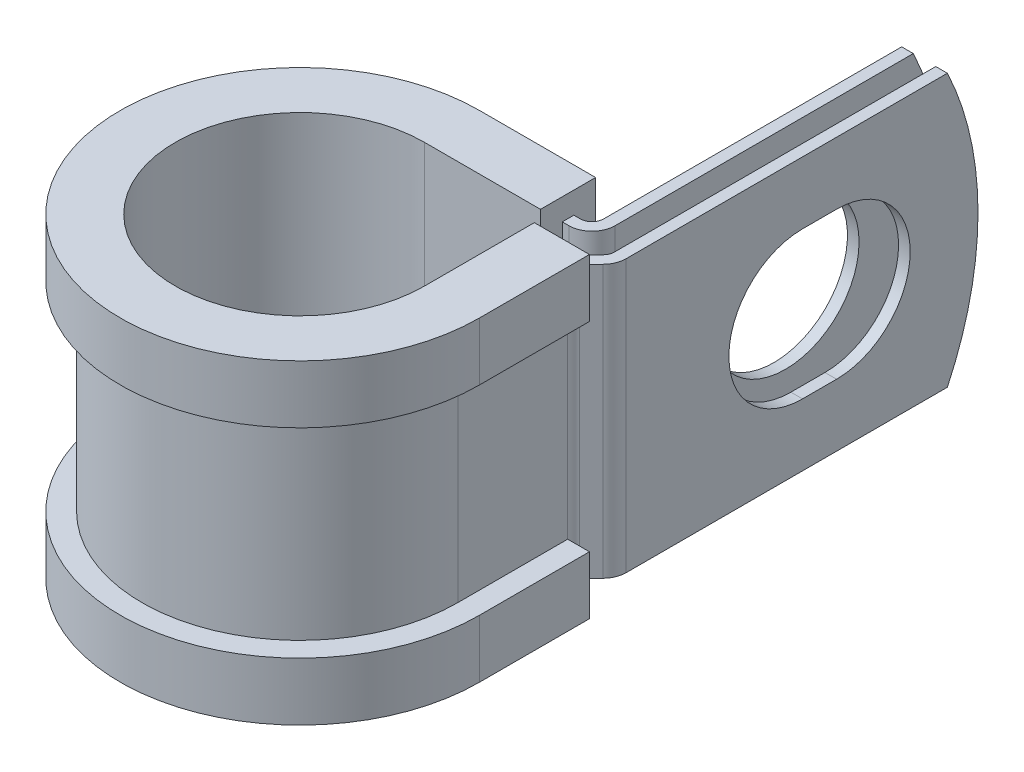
ISO-10303-21;
HEADER;
FILE_DESCRIPTION(('STEP AP214'),'2;1');
FILE_NAME('part.step','',(''),(''),'','','');
FILE_SCHEMA(('AUTOMOTIVE_DESIGN { 1 0 10303 214 1 1 1 1 }'));
ENDSEC;
DATA;
#1=APPLICATION_CONTEXT('core data for automotive mechanical design processes');
#2=APPLICATION_PROTOCOL_DEFINITION('international standard','automotive_design',2000,#1);
#3=PRODUCT_CONTEXT('',#1,'mechanical');
#4=PRODUCT('Part','Part','',(#3));
#5=PRODUCT_RELATED_PRODUCT_CATEGORY('part','',(#4));
#6=PRODUCT_DEFINITION_FORMATION('','',#4);
#7=PRODUCT_DEFINITION_CONTEXT('part definition',#1,'design');
#8=PRODUCT_DEFINITION('design','',#6,#7);
#9=PRODUCT_DEFINITION_SHAPE('','',#8);
#10=(LENGTH_UNIT() NAMED_UNIT(*) SI_UNIT(.MILLI.,.METRE.));
#11=(NAMED_UNIT(*) PLANE_ANGLE_UNIT() SI_UNIT($,.RADIAN.));
#12=(NAMED_UNIT(*) SI_UNIT($,.STERADIAN.) SOLID_ANGLE_UNIT());
#13=UNCERTAINTY_MEASURE_WITH_UNIT(LENGTH_MEASURE(1.E-05),#10,'distance_accuracy_value','');
#14=(GEOMETRIC_REPRESENTATION_CONTEXT(3) GLOBAL_UNCERTAINTY_ASSIGNED_CONTEXT((#13)) GLOBAL_UNIT_ASSIGNED_CONTEXT((#10,
#11,#12)) REPRESENTATION_CONTEXT('',''));
#15=CARTESIAN_POINT('',(0.,0.,0.));
#16=DIRECTION('',(0.,0.,1.));
#17=DIRECTION('',(1.,0.,0.));
#18=AXIS2_PLACEMENT_3D('',#15,#16,#17);
#19=CARTESIAN_POINT('',(10.9764743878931,-9.525,-10.2489));
#20=DIRECTION('',(0.,1.,0.));
#21=DIRECTION('',(1.,0.,0.));
#22=AXIS2_PLACEMENT_3D('',#19,#20,#21);
#23=PLANE('',#22);
#24=DIRECTION('',(0.,0.,-1.));
#25=VECTOR('',#24,1.);
#26=CARTESIAN_POINT('',(8.13167438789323,-9.525,-10.2489));
#27=LINE('',#26,#25);
#28=CARTESIAN_POINT('',(8.13167438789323,-9.525,-10.2489));
#29=VERTEX_POINT('',#28);
#30=CARTESIAN_POINT('',(8.13167438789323,-9.525,-11.0617));
#31=VERTEX_POINT('',#30);
#32=EDGE_CURVE('E523',#29,#31,#27,.T.);
#33=ORIENTED_EDGE('',*,*,#32,.T.);
#34=DIRECTION('',(1.,0.,0.));
#35=VECTOR('',#34,1.);
#36=CARTESIAN_POINT('',(0.,-9.525,-11.0617));
#37=LINE('',#36,#35);
#38=CARTESIAN_POINT('',(8.58887438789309,-9.525,-11.0617));
#39=VERTEX_POINT('',#38);
#40=EDGE_CURVE('E410',#39,#31,#37,.F.);
#41=ORIENTED_EDGE('',*,*,#40,.F.);
#42=CARTESIAN_POINT('',(8.58887438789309,-9.525,-11.8745));
#43=DIRECTION('',(0.,1.,0.));
#44=DIRECTION('',(1.,0.,0.));
#45=AXIS2_PLACEMENT_3D('',#42,#43,#44);
#46=CIRCLE('',#45,0.812799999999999);
#47=CARTESIAN_POINT('',(9.40167438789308,-9.525,-11.8745));
#48=VERTEX_POINT('',#47);
#49=EDGE_CURVE('E408',#48,#39,#46,.F.);
#50=ORIENTED_EDGE('',*,*,#49,.F.);
#51=DIRECTION('',(0.,0.,1.));
#52=VECTOR('',#51,1.);
#53=CARTESIAN_POINT('',(9.40167438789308,-9.525,-34.8996));
#54=LINE('',#53,#52);
#55=CARTESIAN_POINT('',(9.40167438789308,-9.525,-32.7550631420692));
#56=VERTEX_POINT('',#55);
#57=EDGE_CURVE('E406',#56,#48,#54,.T.);
#58=ORIENTED_EDGE('',*,*,#57,.F.);
#59=DIRECTION('',(-1.,0.,0.));
#60=VECTOR('',#59,1.);
#61=CARTESIAN_POINT('',(12.6020743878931,-9.525,-32.7550631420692));
#62=LINE('',#61,#60);
#63=CARTESIAN_POINT('',(10.2144743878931,-9.525,-32.7550631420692));
#64=VERTEX_POINT('',#63);
#65=EDGE_CURVE('E12',#64,#56,#62,.T.);
#66=ORIENTED_EDGE('',*,*,#65,.F.);
#67=DIRECTION('',(0.,0.,1.));
#68=VECTOR('',#67,1.);
#69=CARTESIAN_POINT('',(10.2144743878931,-9.525,-34.8996));
#70=LINE('',#69,#68);
#71=CARTESIAN_POINT('',(10.2144743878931,-9.525,-11.8745));
#72=VERTEX_POINT('',#71);
#73=EDGE_CURVE('E404',#64,#72,#70,.T.);
#74=ORIENTED_EDGE('',*,*,#73,.T.);
#75=CARTESIAN_POINT('',(8.58887438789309,-9.525,-11.8745));
#76=DIRECTION('',(0.,-1.,0.));
#77=DIRECTION('',(0.,0.,1.));
#78=AXIS2_PLACEMENT_3D('',#75,#76,#77);
#79=CIRCLE('',#78,1.6256);
#80=CARTESIAN_POINT('',(8.58887438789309,-9.525,-10.2489));
#81=VERTEX_POINT('',#80);
#82=EDGE_CURVE('E401',#72,#81,#79,.T.);
#83=ORIENTED_EDGE('',*,*,#82,.T.);
#84=DIRECTION('',(-1.,0.,0.));
#85=VECTOR('',#84,1.);
#86=CARTESIAN_POINT('',(0.,-9.525,-10.2489));
#87=LINE('',#86,#85);
#88=EDGE_CURVE('E398',#81,#29,#87,.T.);
#89=ORIENTED_EDGE('',*,*,#88,.T.);
#90=EDGE_LOOP('',(#33,#41,#50,#58,#66,#74,#83,#89));
#91=FACE_BOUND('',#90,.T.);
#92=ADVANCED_FACE('F54',(#91),#23,.F.);
#93=CARTESIAN_POINT('',(10.9764743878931,9.525,-10.2489));
#94=DIRECTION('',(0.,1.,0.));
#95=DIRECTION('',(1.,0.,0.));
#96=AXIS2_PLACEMENT_3D('',#93,#94,#95);
#97=PLANE('',#96);
#98=DIRECTION('',(1.,0.,0.));
#99=VECTOR('',#98,1.);
#100=CARTESIAN_POINT('',(0.,9.525,-11.0617));
#101=LINE('',#100,#99);
#102=CARTESIAN_POINT('',(8.58887438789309,9.525,-11.0617));
#103=VERTEX_POINT('',#102);
#104=CARTESIAN_POINT('',(8.13167438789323,9.525,-11.0617));
#105=VERTEX_POINT('',#104);
#106=EDGE_CURVE('E368',#103,#105,#101,.F.);
#107=ORIENTED_EDGE('',*,*,#106,.T.);
#108=DIRECTION('',(0.,0.,1.));
#109=VECTOR('',#108,1.);
#110=CARTESIAN_POINT('',(8.13167438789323,9.525,-11.0617));
#111=LINE('',#110,#109);
#112=CARTESIAN_POINT('',(8.13167438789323,9.525,-10.2489));
#113=VERTEX_POINT('',#112);
#114=EDGE_CURVE('E517',#105,#113,#111,.T.);
#115=ORIENTED_EDGE('',*,*,#114,.T.);
#116=DIRECTION('',(-1.,0.,0.));
#117=VECTOR('',#116,1.);
#118=CARTESIAN_POINT('',(0.,9.525,-10.2489));
#119=LINE('',#118,#117);
#120=CARTESIAN_POINT('',(8.58887438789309,9.525,-10.2489));
#121=VERTEX_POINT('',#120);
#122=EDGE_CURVE('E625',#121,#113,#119,.T.);
#123=ORIENTED_EDGE('',*,*,#122,.F.);
#124=CARTESIAN_POINT('',(8.58887438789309,9.525,-11.8745));
#125=DIRECTION('',(0.,-1.,0.));
#126=DIRECTION('',(0.,0.,1.));
#127=AXIS2_PLACEMENT_3D('',#124,#125,#126);
#128=CIRCLE('',#127,1.6256);
#129=CARTESIAN_POINT('',(10.2144743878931,9.525,-11.8745));
#130=VERTEX_POINT('',#129);
#131=EDGE_CURVE('E370',#130,#121,#128,.T.);
#132=ORIENTED_EDGE('',*,*,#131,.F.);
#133=DIRECTION('',(0.,0.,1.));
#134=VECTOR('',#133,1.);
#135=CARTESIAN_POINT('',(10.2144743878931,9.525,-34.8996));
#136=LINE('',#135,#134);
#137=CARTESIAN_POINT('',(10.2144743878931,9.525,-32.7550631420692));
#138=VERTEX_POINT('',#137);
#139=EDGE_CURVE('E361',#138,#130,#136,.T.);
#140=ORIENTED_EDGE('',*,*,#139,.F.);
#141=DIRECTION('',(-1.,0.,0.));
#142=VECTOR('',#141,1.);
#143=CARTESIAN_POINT('',(12.6020743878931,9.525,-32.7550631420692));
#144=LINE('',#143,#142);
#145=CARTESIAN_POINT('',(9.40167438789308,9.525,-32.7550631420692));
#146=VERTEX_POINT('',#145);
#147=EDGE_CURVE('E62',#138,#146,#144,.T.);
#148=ORIENTED_EDGE('',*,*,#147,.T.);
#149=DIRECTION('',(0.,0.,1.));
#150=VECTOR('',#149,1.);
#151=CARTESIAN_POINT('',(9.40167438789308,9.525,-34.8996));
#152=LINE('',#151,#150);
#153=CARTESIAN_POINT('',(9.40167438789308,9.525,-11.8745));
#154=VERTEX_POINT('',#153);
#155=EDGE_CURVE('E358',#146,#154,#152,.T.);
#156=ORIENTED_EDGE('',*,*,#155,.T.);
#157=CARTESIAN_POINT('',(8.58887438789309,9.525,-11.8745));
#158=DIRECTION('',(0.,1.,0.));
#159=DIRECTION('',(1.,0.,0.));
#160=AXIS2_PLACEMENT_3D('',#157,#158,#159);
#161=CIRCLE('',#160,0.812799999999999);
#162=EDGE_CURVE('E366',#154,#103,#161,.F.);
#163=ORIENTED_EDGE('',*,*,#162,.T.);
#164=EDGE_LOOP('',(#107,#115,#123,#132,#140,#148,#156,#163));
#165=FACE_BOUND('',#164,.T.);
#166=ADVANCED_FACE('F357',(#165),#97,.T.);
#167=CARTESIAN_POINT('',(0.,9.525,-10.2489));
#168=DIRECTION('',(0.,0.,1.));
#169=DIRECTION('',(1.,0.,0.));
#170=AXIS2_PLACEMENT_3D('',#167,#168,#169);
#171=PLANE('',#170);
#172=ORIENTED_EDGE('',*,*,#122,.T.);
#173=DIRECTION('',(0.,-1.,0.));
#174=VECTOR('',#173,1.);
#175=CARTESIAN_POINT('',(8.13167438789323,9.525,-10.2489));
#176=LINE('',#175,#174);
#177=EDGE_CURVE('E520',#113,#29,#176,.T.);
#178=ORIENTED_EDGE('',*,*,#177,.T.);
#179=ORIENTED_EDGE('',*,*,#88,.F.);
#180=DIRECTION('',(0.,-1.,0.));
#181=VECTOR('',#180,1.);
#182=CARTESIAN_POINT('',(8.58887438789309,9.525,-10.2489));
#183=LINE('',#182,#181);
#184=EDGE_CURVE('E344',#121,#81,#183,.T.);
#185=ORIENTED_EDGE('',*,*,#184,.F.);
#186=EDGE_LOOP('',(#172,#178,#179,#185));
#187=FACE_BOUND('',#186,.T.);
#188=ADVANCED_FACE('F635',(#187),#171,.T.);
#189=CARTESIAN_POINT('',(12.6020743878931,9.525,-10.2489));
#190=DIRECTION('',(-1.,0.,0.));
#191=DIRECTION('',(0.,0.,1.));
#192=AXIS2_PLACEMENT_3D('',#189,#190,#191);
#193=PLANE('',#192);
#194=CARTESIAN_POINT('',(12.6020743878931,0.,-24.9935999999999));
#195=DIRECTION('',(1.,0.,0.));
#196=DIRECTION('',(0.,0.,-1.));
#197=AXIS2_PLACEMENT_3D('',#194,#195,#196);
#198=CIRCLE('',#197,5.1562);
#199=CARTESIAN_POINT('',(12.6020743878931,-5.1562,-24.9936000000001));
#200=VERTEX_POINT('',#199);
#201=CARTESIAN_POINT('',(12.6020743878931,5.1562,-24.9936000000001));
#202=VERTEX_POINT('',#201);
#203=EDGE_CURVE('E580',#200,#202,#198,.T.);
#204=ORIENTED_EDGE('',*,*,#203,.F.);
#205=DIRECTION('',(0.,0.,-1.));
#206=VECTOR('',#205,1.);
#207=CARTESIAN_POINT('',(12.6020743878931,-5.1562,-22.6059999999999));
#208=LINE('',#207,#206);
#209=CARTESIAN_POINT('',(12.6020743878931,-5.1562,-22.6059999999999));
#210=VERTEX_POINT('',#209);
#211=EDGE_CURVE('E583',#210,#200,#208,.T.);
#212=ORIENTED_EDGE('',*,*,#211,.F.);
#213=CARTESIAN_POINT('',(12.6020743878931,0.,-22.6059999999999));
#214=DIRECTION('',(1.,0.,0.));
#215=DIRECTION('',(0.,0.,-1.));
#216=AXIS2_PLACEMENT_3D('',#213,#214,#215);
#217=CIRCLE('',#216,5.1562);
#218=CARTESIAN_POINT('',(12.6020743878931,5.1562,-22.6059999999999));
#219=VERTEX_POINT('',#218);
#220=EDGE_CURVE('E576',#219,#210,#217,.T.);
#221=ORIENTED_EDGE('',*,*,#220,.F.);
#222=DIRECTION('',(0.,0.,1.));
#223=VECTOR('',#222,1.);
#224=CARTESIAN_POINT('',(12.6020743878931,5.1562,-22.6059999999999));
#225=LINE('',#224,#223);
#226=EDGE_CURVE('E577',#202,#219,#225,.T.);
#227=ORIENTED_EDGE('',*,*,#226,.F.);
#228=EDGE_LOOP('',(#204,#212,#221,#227));
#229=FACE_BOUND('',#228,.T.);
#230=DIRECTION('',(0.,0.,-1.));
#231=VECTOR('',#230,1.);
#232=CARTESIAN_POINT('',(12.6020743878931,-9.525,-10.2489));
#233=LINE('',#232,#231);
#234=CARTESIAN_POINT('',(12.6020743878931,-9.525,-10.2489));
#235=VERTEX_POINT('',#234);
#236=CARTESIAN_POINT('',(12.6020743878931,-9.525,-32.7550631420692));
#237=VERTEX_POINT('',#236);
#238=EDGE_CURVE('E382',#235,#237,#233,.T.);
#239=ORIENTED_EDGE('',*,*,#238,.T.);
#240=CARTESIAN_POINT('',(12.6020743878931,0.,-12.6746));
#241=DIRECTION('',(-1.,0.,0.));
#242=DIRECTION('',(0.,0.,1.));
#243=AXIS2_PLACEMENT_3D('',#240,#241,#242);
#244=CIRCLE('',#243,22.225);
#245=CARTESIAN_POINT('',(12.6020743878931,9.525,-32.7550631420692));
#246=VERTEX_POINT('',#245);
#247=EDGE_CURVE('E568',#246,#237,#244,.T.);
#248=ORIENTED_EDGE('',*,*,#247,.F.);
#249=DIRECTION('',(0.,0.,-1.));
#250=VECTOR('',#249,1.);
#251=CARTESIAN_POINT('',(12.6020743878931,9.525,-10.2489));
#252=LINE('',#251,#250);
#253=CARTESIAN_POINT('',(12.6020743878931,9.525,-10.2489));
#254=VERTEX_POINT('',#253);
#255=EDGE_CURVE('E419',#254,#246,#252,.T.);
#256=ORIENTED_EDGE('',*,*,#255,.F.);
#257=DIRECTION('',(0.,-1.,0.));
#258=VECTOR('',#257,1.);
#259=CARTESIAN_POINT('',(12.6020743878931,9.525,-10.2489));
#260=LINE('',#259,#258);
#261=EDGE_CURVE('E381',#254,#235,#260,.T.);
#262=ORIENTED_EDGE('',*,*,#261,.T.);
#263=EDGE_LOOP('',(#239,#248,#256,#262));
#264=FACE_BOUND('',#263,.T.);
#265=ADVANCED_FACE('F56',(#229,#264),#193,.F.);
#266=CARTESIAN_POINT('',(11.7892743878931,9.525,-10.2489));
#267=DIRECTION('',(-1.,0.,0.));
#268=DIRECTION('',(0.,0.,1.));
#269=AXIS2_PLACEMENT_3D('',#266,#267,#268);
#270=PLANE('',#269);
#271=DIRECTION('',(0.,0.,-1.));
#272=VECTOR('',#271,1.);
#273=CARTESIAN_POINT('',(11.7892743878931,-5.1562,-22.6059999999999));
#274=LINE('',#273,#272);
#275=CARTESIAN_POINT('',(11.7892743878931,-5.1562,-22.6059999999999));
#276=VERTEX_POINT('',#275);
#277=CARTESIAN_POINT('',(11.7892743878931,-5.1562,-24.9936000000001));
#278=VERTEX_POINT('',#277);
#279=EDGE_CURVE('E579',#276,#278,#274,.T.);
#280=ORIENTED_EDGE('',*,*,#279,.T.);
#281=CARTESIAN_POINT('',(11.7892743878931,0.,-24.9935999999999));
#282=DIRECTION('',(-1.,0.,0.));
#283=DIRECTION('',(0.,0.,1.));
#284=AXIS2_PLACEMENT_3D('',#281,#282,#283);
#285=CIRCLE('',#284,5.1562);
#286=CARTESIAN_POINT('',(11.7892743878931,5.1562,-24.9936000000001));
#287=VERTEX_POINT('',#286);
#288=EDGE_CURVE('E600',#278,#287,#285,.F.);
#289=ORIENTED_EDGE('',*,*,#288,.T.);
#290=DIRECTION('',(0.,0.,1.));
#291=VECTOR('',#290,1.);
#292=CARTESIAN_POINT('',(11.7892743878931,5.1562,-22.6059999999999));
#293=LINE('',#292,#291);
#294=CARTESIAN_POINT('',(11.7892743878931,5.1562,-22.6059999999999));
#295=VERTEX_POINT('',#294);
#296=EDGE_CURVE('E596',#287,#295,#293,.T.);
#297=ORIENTED_EDGE('',*,*,#296,.T.);
#298=CARTESIAN_POINT('',(11.7892743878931,0.,-22.6059999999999));
#299=DIRECTION('',(-1.,0.,0.));
#300=DIRECTION('',(0.,0.,1.));
#301=AXIS2_PLACEMENT_3D('',#298,#299,#300);
#302=CIRCLE('',#301,5.1562);
#303=EDGE_CURVE('E591',#295,#276,#302,.F.);
#304=ORIENTED_EDGE('',*,*,#303,.T.);
#305=EDGE_LOOP('',(#280,#289,#297,#304));
#306=FACE_BOUND('',#305,.T.);
#307=CARTESIAN_POINT('',(11.7892743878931,0.,-12.6746));
#308=DIRECTION('',(-1.,0.,0.));
#309=DIRECTION('',(0.,0.,1.));
#310=AXIS2_PLACEMENT_3D('',#307,#308,#309);
#311=CIRCLE('',#310,22.225);
#312=CARTESIAN_POINT('',(11.7892743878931,9.525,-32.7550631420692));
#313=VERTEX_POINT('',#312);
#314=CARTESIAN_POINT('',(11.7892743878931,-9.525,-32.7550631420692));
#315=VERTEX_POINT('',#314);
#316=EDGE_CURVE('E76',#313,#315,#311,.T.);
#317=ORIENTED_EDGE('',*,*,#316,.T.);
#318=DIRECTION('',(0.,0.,-1.));
#319=VECTOR('',#318,1.);
#320=CARTESIAN_POINT('',(11.7892743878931,-9.525,-10.2489));
#321=LINE('',#320,#319);
#322=CARTESIAN_POINT('',(11.7892743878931,-9.525,-10.2489));
#323=VERTEX_POINT('',#322);
#324=EDGE_CURVE('E385',#323,#315,#321,.T.);
#325=ORIENTED_EDGE('',*,*,#324,.F.);
#326=DIRECTION('',(0.,-1.,0.));
#327=VECTOR('',#326,1.);
#328=CARTESIAN_POINT('',(11.7892743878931,9.525,-10.2489));
#329=LINE('',#328,#327);
#330=CARTESIAN_POINT('',(11.7892743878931,9.525,-10.2489));
#331=VERTEX_POINT('',#330);
#332=EDGE_CURVE('E352',#331,#323,#329,.T.);
#333=ORIENTED_EDGE('',*,*,#332,.F.);
#334=DIRECTION('',(0.,0.,-1.));
#335=VECTOR('',#334,1.);
#336=CARTESIAN_POINT('',(11.7892743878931,9.525,-10.2489));
#337=LINE('',#336,#335);
#338=EDGE_CURVE('E615',#331,#313,#337,.T.);
#339=ORIENTED_EDGE('',*,*,#338,.T.);
#340=EDGE_LOOP('',(#317,#325,#333,#339));
#341=FACE_BOUND('',#340,.T.);
#342=ADVANCED_FACE('F689',(#306,#341),#270,.T.);
#343=CARTESIAN_POINT('',(10.2144743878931,9.525,-34.8996));
#344=DIRECTION('',(1.,0.,0.));
#345=DIRECTION('',(0.,0.,-1.));
#346=AXIS2_PLACEMENT_3D('',#343,#344,#345);
#347=PLANE('',#346);
#348=CARTESIAN_POINT('',(10.2144743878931,0.,-23.7998));
#349=DIRECTION('',(1.,0.,0.));
#350=DIRECTION('',(0.,0.,-1.));
#351=AXIS2_PLACEMENT_3D('',#348,#349,#350);
#352=CIRCLE('',#351,5.1562);
#353=CARTESIAN_POINT('',(10.2144743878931,0.,-28.956));
#354=VERTEX_POINT('',#353);
#355=EDGE_CURVE('E386',#354,#354,#352,.F.);
#356=ORIENTED_EDGE('',*,*,#355,.T.);
#357=EDGE_LOOP('',(#356));
#358=FACE_BOUND('',#357,.T.);
#359=ORIENTED_EDGE('',*,*,#73,.F.);
#360=CARTESIAN_POINT('',(10.2144743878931,0.,-12.6746));
#361=DIRECTION('',(1.,0.,0.));
#362=DIRECTION('',(0.,0.,-1.));
#363=AXIS2_PLACEMENT_3D('',#360,#361,#362);
#364=CIRCLE('',#363,22.225);
#365=EDGE_CURVE('E573',#64,#138,#364,.T.);
#366=ORIENTED_EDGE('',*,*,#365,.T.);
#367=ORIENTED_EDGE('',*,*,#139,.T.);
#368=DIRECTION('',(0.,-1.,0.));
#369=VECTOR('',#368,1.);
#370=CARTESIAN_POINT('',(10.2144743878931,9.525,-11.8745));
#371=LINE('',#370,#369);
#372=EDGE_CURVE('E341',#130,#72,#371,.T.);
#373=ORIENTED_EDGE('',*,*,#372,.T.);
#374=EDGE_LOOP('',(#359,#366,#367,#373));
#375=FACE_BOUND('',#374,.T.);
#376=ADVANCED_FACE('F641',(#358,#375),#347,.T.);
#377=CARTESIAN_POINT('',(9.40167438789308,9.525,-34.8996));
#378=DIRECTION('',(1.,0.,0.));
#379=DIRECTION('',(0.,0.,-1.));
#380=AXIS2_PLACEMENT_3D('',#377,#378,#379);
#381=PLANE('',#380);
#382=CARTESIAN_POINT('',(9.40167438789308,0.,-23.7998));
#383=DIRECTION('',(-1.,0.,0.));
#384=DIRECTION('',(0.,0.,1.));
#385=AXIS2_PLACEMENT_3D('',#382,#383,#384);
#386=CIRCLE('',#385,5.1562);
#387=CARTESIAN_POINT('',(9.40167438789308,0.,-18.6436));
#388=VERTEX_POINT('',#387);
#389=EDGE_CURVE('E608',#388,#388,#386,.T.);
#390=ORIENTED_EDGE('',*,*,#389,.F.);
#391=EDGE_LOOP('',(#390));
#392=FACE_BOUND('',#391,.T.);
#393=CARTESIAN_POINT('',(9.40167438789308,0.,-12.6746));
#394=DIRECTION('',(-1.,0.,0.));
#395=DIRECTION('',(0.,0.,1.));
#396=AXIS2_PLACEMENT_3D('',#393,#394,#395);
#397=CIRCLE('',#396,22.225);
#398=EDGE_CURVE('E68',#146,#56,#397,.T.);
#399=ORIENTED_EDGE('',*,*,#398,.T.);
#400=ORIENTED_EDGE('',*,*,#57,.T.);
#401=DIRECTION('',(0.,-1.,0.));
#402=VECTOR('',#401,1.);
#403=CARTESIAN_POINT('',(9.40167438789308,9.525,-11.8745));
#404=LINE('',#403,#402);
#405=EDGE_CURVE('E338',#154,#48,#404,.T.);
#406=ORIENTED_EDGE('',*,*,#405,.F.);
#407=ORIENTED_EDGE('',*,*,#155,.F.);
#408=EDGE_LOOP('',(#399,#400,#406,#407));
#409=FACE_BOUND('',#408,.T.);
#410=ADVANCED_FACE('F364',(#392,#409),#381,.F.);
#411=CARTESIAN_POINT('',(11.8745,-9.525,-7.69850726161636));
#412=DIRECTION('',(0.,1.,0.));
#413=DIRECTION('',(1.,0.,0.));
#414=AXIS2_PLACEMENT_3D('',#411,#412,#413);
#415=CIRCLE('',#414,0.8128);
#416=CARTESIAN_POINT('',(11.0617,-9.525,-7.69850726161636));
#417=VERTEX_POINT('',#416);
#418=CARTESIAN_POINT('',(11.2997636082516,-9.525,-8.27324365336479));
#419=VERTEX_POINT('',#418);
#420=EDGE_CURVE('E413',#417,#419,#415,.F.);
#421=ORIENTED_EDGE('',*,*,#420,.F.);
#422=DIRECTION('',(1.,0.,0.));
#423=VECTOR('',#422,1.);
#424=CARTESIAN_POINT('',(10.2489,-9.525,-7.69850726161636));
#425=LINE('',#424,#423);
#426=CARTESIAN_POINT('',(10.2489,-9.525,-7.69850726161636));
#427=VERTEX_POINT('',#426);
#428=EDGE_CURVE('E451',#427,#417,#425,.T.);
#429=ORIENTED_EDGE('',*,*,#428,.F.);
#430=CARTESIAN_POINT('',(11.8745,-9.525,-7.69850726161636));
#431=DIRECTION('',(0.,-1.,0.));
#432=DIRECTION('',(0.,0.,1.));
#433=AXIS2_PLACEMENT_3D('',#430,#431,#432);
#434=CIRCLE('',#433,1.6256);
#435=CARTESIAN_POINT('',(10.7250272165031,-9.525,-8.84798004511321));
#436=VERTEX_POINT('',#435);
#437=EDGE_CURVE('E395',#427,#436,#434,.T.);
#438=ORIENTED_EDGE('',*,*,#437,.T.);
#439=DIRECTION('',(0.707106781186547,0.,-0.707106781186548));
#440=VECTOR('',#439,1.);
#441=CARTESIAN_POINT('',(10.7250272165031,-9.525,-8.84798004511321));
#442=LINE('',#441,#440);
#443=CARTESIAN_POINT('',(11.5512107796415,-9.525,-9.67416360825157));
#444=VERTEX_POINT('',#443);
#445=EDGE_CURVE('E392',#436,#444,#442,.T.);
#446=ORIENTED_EDGE('',*,*,#445,.T.);
#447=CARTESIAN_POINT('',(10.9764743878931,-9.525,-10.2489));
#448=DIRECTION('',(0.,1.,0.));
#449=DIRECTION('',(0.,0.,1.));
#450=AXIS2_PLACEMENT_3D('',#447,#448,#449);
#451=CIRCLE('',#450,0.812800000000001);
#452=EDGE_CURVE('E389',#444,#323,#451,.T.);
#453=ORIENTED_EDGE('',*,*,#452,.T.);
#454=ORIENTED_EDGE('',*,*,#324,.T.);
#455=DIRECTION('',(-1.,0.,0.));
#456=VECTOR('',#455,1.);
#457=CARTESIAN_POINT('',(12.6020743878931,-9.525,-32.7550631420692));
#458=LINE('',#457,#456);
#459=EDGE_CURVE('E566',#237,#315,#458,.T.);
#460=ORIENTED_EDGE('',*,*,#459,.F.);
#461=ORIENTED_EDGE('',*,*,#238,.F.);
#462=CARTESIAN_POINT('',(10.9764743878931,-9.525,-10.2489));
#463=DIRECTION('',(0.,1.,0.));
#464=DIRECTION('',(1.,0.,0.));
#465=AXIS2_PLACEMENT_3D('',#462,#463,#464);
#466=CIRCLE('',#465,1.6256);
#467=CARTESIAN_POINT('',(12.1259471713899,-9.525,-9.09942721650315));
#468=VERTEX_POINT('',#467);
#469=EDGE_CURVE('E417',#468,#235,#466,.T.);
#470=ORIENTED_EDGE('',*,*,#469,.F.);
#471=DIRECTION('',(0.707106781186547,0.,-0.707106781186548));
#472=VECTOR('',#471,1.);
#473=CARTESIAN_POINT('',(11.2997636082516,-9.525,-8.27324365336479));
#474=LINE('',#473,#472);
#475=EDGE_CURVE('E415',#419,#468,#474,.T.);
#476=ORIENTED_EDGE('',*,*,#475,.F.);
#477=EDGE_LOOP('',(#421,#429,#438,#446,#453,#454,#460,#461,#470,#476));
#478=FACE_BOUND('',#477,.T.);
#479=ADVANCED_FACE('F675',(#478),#23,.F.);
#480=DIRECTION('',(-1.,0.,0.));
#481=VECTOR('',#480,1.);
#482=CARTESIAN_POINT('',(11.0617,9.525,-7.69850726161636));
#483=LINE('',#482,#481);
#484=CARTESIAN_POINT('',(11.0617,9.525,-7.69850726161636));
#485=VERTEX_POINT('',#484);
#486=CARTESIAN_POINT('',(10.2489,9.525,-7.69850726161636));
#487=VERTEX_POINT('',#486);
#488=EDGE_CURVE('E440',#485,#487,#483,.T.);
#489=ORIENTED_EDGE('',*,*,#488,.F.);
#490=CARTESIAN_POINT('',(11.8745,9.525,-7.69850726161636));
#491=DIRECTION('',(0.,1.,0.));
#492=DIRECTION('',(1.,0.,0.));
#493=AXIS2_PLACEMENT_3D('',#490,#491,#492);
#494=CIRCLE('',#493,0.8128);
#495=CARTESIAN_POINT('',(11.2997636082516,9.525,-8.27324365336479));
#496=VERTEX_POINT('',#495);
#497=EDGE_CURVE('E375',#485,#496,#494,.F.);
#498=ORIENTED_EDGE('',*,*,#497,.T.);
#499=DIRECTION('',(0.707106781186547,0.,-0.707106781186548));
#500=VECTOR('',#499,1.);
#501=CARTESIAN_POINT('',(11.2997636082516,9.525,-8.27324365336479));
#502=LINE('',#501,#500);
#503=CARTESIAN_POINT('',(12.1259471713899,9.525,-9.09942721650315));
#504=VERTEX_POINT('',#503);
#505=EDGE_CURVE('E377',#496,#504,#502,.T.);
#506=ORIENTED_EDGE('',*,*,#505,.T.);
#507=CARTESIAN_POINT('',(10.9764743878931,9.525,-10.2489));
#508=DIRECTION('',(0.,1.,0.));
#509=DIRECTION('',(1.,0.,0.));
#510=AXIS2_PLACEMENT_3D('',#507,#508,#509);
#511=CIRCLE('',#510,1.6256);
#512=EDGE_CURVE('E379',#504,#254,#511,.T.);
#513=ORIENTED_EDGE('',*,*,#512,.T.);
#514=ORIENTED_EDGE('',*,*,#255,.T.);
#515=DIRECTION('',(-1.,0.,0.));
#516=VECTOR('',#515,1.);
#517=CARTESIAN_POINT('',(12.6020743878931,9.525,-32.7550631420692));
#518=LINE('',#517,#516);
#519=EDGE_CURVE('E570',#246,#313,#518,.T.);
#520=ORIENTED_EDGE('',*,*,#519,.T.);
#521=ORIENTED_EDGE('',*,*,#338,.F.);
#522=CARTESIAN_POINT('',(10.9764743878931,9.525,-10.2489));
#523=DIRECTION('',(0.,1.,0.));
#524=DIRECTION('',(0.,0.,1.));
#525=AXIS2_PLACEMENT_3D('',#522,#523,#524);
#526=CIRCLE('',#525,0.812800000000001);
#527=CARTESIAN_POINT('',(11.5512107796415,9.525,-9.67416360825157));
#528=VERTEX_POINT('',#527);
#529=EDGE_CURVE('E618',#528,#331,#526,.T.);
#530=ORIENTED_EDGE('',*,*,#529,.F.);
#531=DIRECTION('',(0.707106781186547,0.,-0.707106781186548));
#532=VECTOR('',#531,1.);
#533=CARTESIAN_POINT('',(10.7250272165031,9.525,-8.84798004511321));
#534=LINE('',#533,#532);
#535=CARTESIAN_POINT('',(10.7250272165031,9.525,-8.84798004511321));
#536=VERTEX_POINT('',#535);
#537=EDGE_CURVE('E621',#536,#528,#534,.T.);
#538=ORIENTED_EDGE('',*,*,#537,.F.);
#539=CARTESIAN_POINT('',(11.8745,9.525,-7.69850726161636));
#540=DIRECTION('',(0.,-1.,0.));
#541=DIRECTION('',(0.,0.,1.));
#542=AXIS2_PLACEMENT_3D('',#539,#540,#541);
#543=CIRCLE('',#542,1.6256);
#544=EDGE_CURVE('E450',#487,#536,#543,.T.);
#545=ORIENTED_EDGE('',*,*,#544,.F.);
#546=EDGE_LOOP('',(#489,#498,#506,#513,#514,#520,#521,#530,#538,#545));
#547=FACE_BOUND('',#546,.T.);
#548=ADVANCED_FACE('F447',(#547),#97,.T.);
#549=CARTESIAN_POINT('',(10.9764743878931,9.525,-10.2489));
#550=DIRECTION('',(0.,-1.,0.));
#551=DIRECTION('',(0.,0.,-1.));
#552=AXIS2_PLACEMENT_3D('',#549,#550,#551);
#553=CYLINDRICAL_SURFACE('',#552,0.812800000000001);
#554=ORIENTED_EDGE('',*,*,#452,.F.);
#555=DIRECTION('',(0.,-1.,0.));
#556=VECTOR('',#555,1.);
#557=CARTESIAN_POINT('',(11.5512107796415,9.525,-9.67416360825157));
#558=LINE('',#557,#556);
#559=EDGE_CURVE('E350',#528,#444,#558,.T.);
#560=ORIENTED_EDGE('',*,*,#559,.F.);
#561=ORIENTED_EDGE('',*,*,#529,.T.);
#562=ORIENTED_EDGE('',*,*,#332,.T.);
#563=EDGE_LOOP('',(#554,#560,#561,#562));
#564=FACE_BOUND('',#563,.T.);
#565=ADVANCED_FACE('F685',(#564),#553,.F.);
#566=CARTESIAN_POINT('',(10.7250272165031,9.525,-8.84798004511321));
#567=DIRECTION('',(-0.707106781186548,0.,-0.707106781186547));
#568=DIRECTION('',(-0.707106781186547,0.,0.707106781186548));
#569=AXIS2_PLACEMENT_3D('',#566,#567,#568);
#570=PLANE('',#569);
#571=ORIENTED_EDGE('',*,*,#445,.F.);
#572=DIRECTION('',(0.,-1.,0.));
#573=VECTOR('',#572,1.);
#574=CARTESIAN_POINT('',(10.7250272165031,9.525,-8.84798004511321));
#575=LINE('',#574,#573);
#576=EDGE_CURVE('E348',#536,#436,#575,.T.);
#577=ORIENTED_EDGE('',*,*,#576,.F.);
#578=ORIENTED_EDGE('',*,*,#537,.T.);
#579=ORIENTED_EDGE('',*,*,#559,.T.);
#580=EDGE_LOOP('',(#571,#577,#578,#579));
#581=FACE_BOUND('',#580,.T.);
#582=ADVANCED_FACE('F680',(#581),#570,.T.);
#583=CARTESIAN_POINT('',(11.8745,9.525,-7.69850726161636));
#584=DIRECTION('',(0.,-1.,0.));
#585=DIRECTION('',(0.,0.,-1.));
#586=AXIS2_PLACEMENT_3D('',#583,#584,#585);
#587=CYLINDRICAL_SURFACE('',#586,1.6256);
#588=ORIENTED_EDGE('',*,*,#437,.F.);
#589=DIRECTION('',(0.,-1.,0.));
#590=VECTOR('',#589,1.);
#591=CARTESIAN_POINT('',(10.2489,9.525,-7.69850726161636));
#592=LINE('',#591,#590);
#593=EDGE_CURVE('E346',#487,#427,#592,.T.);
#594=ORIENTED_EDGE('',*,*,#593,.F.);
#595=ORIENTED_EDGE('',*,*,#544,.T.);
#596=ORIENTED_EDGE('',*,*,#576,.T.);
#597=EDGE_LOOP('',(#588,#594,#595,#596));
#598=FACE_BOUND('',#597,.T.);
#599=ADVANCED_FACE('F677',(#598),#587,.T.);
#600=CARTESIAN_POINT('',(8.58887438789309,9.525,-11.8745));
#601=DIRECTION('',(0.,-1.,0.));
#602=DIRECTION('',(0.,0.,-1.));
#603=AXIS2_PLACEMENT_3D('',#600,#601,#602);
#604=CYLINDRICAL_SURFACE('',#603,1.6256);
#605=ORIENTED_EDGE('',*,*,#82,.F.);
#606=ORIENTED_EDGE('',*,*,#372,.F.);
#607=ORIENTED_EDGE('',*,*,#131,.T.);
#608=ORIENTED_EDGE('',*,*,#184,.T.);
#609=EDGE_LOOP('',(#605,#606,#607,#608));
#610=FACE_BOUND('',#609,.T.);
#611=ADVANCED_FACE('F631',(#610),#604,.T.);
#612=CARTESIAN_POINT('',(8.58887438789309,9.525,-11.8745));
#613=DIRECTION('',(0.,-1.,0.));
#614=DIRECTION('',(0.,0.,-1.));
#615=AXIS2_PLACEMENT_3D('',#612,#613,#614);
#616=CYLINDRICAL_SURFACE('',#615,0.812799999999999);
#617=ORIENTED_EDGE('',*,*,#49,.T.);
#618=DIRECTION('',(0.,-1.,0.));
#619=VECTOR('',#618,1.);
#620=CARTESIAN_POINT('',(8.58887438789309,9.525,-11.0617));
#621=LINE('',#620,#619);
#622=EDGE_CURVE('E329',#103,#39,#621,.T.);
#623=ORIENTED_EDGE('',*,*,#622,.F.);
#624=ORIENTED_EDGE('',*,*,#162,.F.);
#625=ORIENTED_EDGE('',*,*,#405,.T.);
#626=EDGE_LOOP('',(#617,#623,#624,#625));
#627=FACE_BOUND('',#626,.T.);
#628=ADVANCED_FACE('F646',(#627),#616,.F.);
#629=CARTESIAN_POINT('',(0.,9.525,-11.0617));
#630=DIRECTION('',(0.,0.,1.));
#631=DIRECTION('',(1.,0.,0.));
#632=AXIS2_PLACEMENT_3D('',#629,#630,#631);
#633=PLANE('',#632);
#634=DIRECTION('',(0.,-1.,0.));
#635=VECTOR('',#634,1.);
#636=CARTESIAN_POINT('',(0.,9.525,-11.0617));
#637=LINE('',#636,#635);
#638=CARTESIAN_POINT('',(1.55164210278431E-13,6.985,-11.0617));
#639=VERTEX_POINT('',#638);
#640=CARTESIAN_POINT('',(1.55164210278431E-13,-6.985,-11.0617));
#641=VERTEX_POINT('',#640);
#642=EDGE_CURVE('E320',#639,#641,#637,.T.);
#643=ORIENTED_EDGE('',*,*,#642,.F.);
#644=DIRECTION('',(1.,0.,0.));
#645=VECTOR('',#644,1.);
#646=CARTESIAN_POINT('',(1.55164210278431E-13,6.985,-11.0617));
#647=LINE('',#646,#645);
#648=CARTESIAN_POINT('',(8.13167438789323,6.985,-11.0617));
#649=VERTEX_POINT('',#648);
#650=EDGE_CURVE('E563',#639,#649,#647,.T.);
#651=ORIENTED_EDGE('',*,*,#650,.T.);
#652=DIRECTION('',(0.,1.,0.));
#653=VECTOR('',#652,1.);
#654=CARTESIAN_POINT('',(8.13167438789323,9.525,-11.0617));
#655=LINE('',#654,#653);
#656=EDGE_CURVE('E514',#649,#105,#655,.T.);
#657=ORIENTED_EDGE('',*,*,#656,.T.);
#658=ORIENTED_EDGE('',*,*,#106,.F.);
#659=ORIENTED_EDGE('',*,*,#622,.T.);
#660=ORIENTED_EDGE('',*,*,#40,.T.);
#661=DIRECTION('',(0.,1.,0.));
#662=VECTOR('',#661,1.);
#663=CARTESIAN_POINT('',(8.13167438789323,-9.525,-11.0617));
#664=LINE('',#663,#662);
#665=CARTESIAN_POINT('',(8.13167438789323,-6.985,-11.0617));
#666=VERTEX_POINT('',#665);
#667=EDGE_CURVE('E526',#31,#666,#664,.T.);
#668=ORIENTED_EDGE('',*,*,#667,.T.);
#669=DIRECTION('',(1.,0.,0.));
#670=VECTOR('',#669,1.);
#671=CARTESIAN_POINT('',(1.55164210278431E-13,-6.985,-11.0617));
#672=LINE('',#671,#670);
#673=EDGE_CURVE('E543',#641,#666,#672,.T.);
#674=ORIENTED_EDGE('',*,*,#673,.F.);
#675=EDGE_LOOP('',(#643,#651,#657,#658,#659,#660,#668,#674));
#676=FACE_BOUND('',#675,.T.);
#677=ADVANCED_FACE('F650',(#676),#633,.F.);
#678=CARTESIAN_POINT('',(0.,9.525,0.));
#679=DIRECTION('',(0.,-1.,0.));
#680=DIRECTION('',(0.,0.,-1.));
#681=AXIS2_PLACEMENT_3D('',#678,#679,#680);
#682=CYLINDRICAL_SURFACE('',#681,11.0617);
#683=DIRECTION('',(0.,-1.,0.));
#684=VECTOR('',#683,1.);
#685=CARTESIAN_POINT('',(11.0617,9.525,0.));
#686=LINE('',#685,#684);
#687=CARTESIAN_POINT('',(11.0617,6.985,0.));
#688=VERTEX_POINT('',#687);
#689=CARTESIAN_POINT('',(11.0617,-6.985,0.));
#690=VERTEX_POINT('',#689);
#691=EDGE_CURVE('E318',#688,#690,#686,.T.);
#692=ORIENTED_EDGE('',*,*,#691,.F.);
#693=CARTESIAN_POINT('',(0.,6.985,0.));
#694=DIRECTION('',(0.,-1.,0.));
#695=DIRECTION('',(0.,0.,-1.));
#696=AXIS2_PLACEMENT_3D('',#693,#694,#695);
#697=CIRCLE('',#696,11.0617);
#698=EDGE_CURVE('E512',#688,#639,#697,.T.);
#699=ORIENTED_EDGE('',*,*,#698,.T.);
#700=ORIENTED_EDGE('',*,*,#642,.T.);
#701=CARTESIAN_POINT('',(0.,-6.985,0.));
#702=DIRECTION('',(0.,-1.,0.));
#703=DIRECTION('',(0.,0.,-1.));
#704=AXIS2_PLACEMENT_3D('',#701,#702,#703);
#705=CIRCLE('',#704,11.0617);
#706=EDGE_CURVE('E301',#690,#641,#705,.T.);
#707=ORIENTED_EDGE('',*,*,#706,.F.);
#708=EDGE_LOOP('',(#692,#699,#700,#707));
#709=FACE_BOUND('',#708,.T.);
#710=ADVANCED_FACE('F316',(#709),#682,.T.);
#711=CARTESIAN_POINT('',(11.0617,9.525,0.));
#712=DIRECTION('',(-1.,0.,0.));
#713=DIRECTION('',(0.,0.,1.));
#714=AXIS2_PLACEMENT_3D('',#711,#712,#713);
#715=PLANE('',#714);
#716=DIRECTION('',(0.,-1.,0.));
#717=VECTOR('',#716,1.);
#718=CARTESIAN_POINT('',(11.0617,9.525,-7.69850726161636));
#719=LINE('',#718,#717);
#720=CARTESIAN_POINT('',(11.0617,6.985,-7.69850726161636));
#721=VERTEX_POINT('',#720);
#722=CARTESIAN_POINT('',(11.0617,-6.985,-7.69850726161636));
#723=VERTEX_POINT('',#722);
#724=EDGE_CURVE('E332',#721,#723,#719,.T.);
#725=ORIENTED_EDGE('',*,*,#724,.F.);
#726=DIRECTION('',(0.,0.,-1.));
#727=VECTOR('',#726,1.);
#728=CARTESIAN_POINT('',(11.0617,6.985,0.));
#729=LINE('',#728,#727);
#730=EDGE_CURVE('E326',#688,#721,#729,.T.);
#731=ORIENTED_EDGE('',*,*,#730,.F.);
#732=ORIENTED_EDGE('',*,*,#691,.T.);
#733=DIRECTION('',(0.,0.,-1.));
#734=VECTOR('',#733,1.);
#735=CARTESIAN_POINT('',(11.0617,-6.985,0.));
#736=LINE('',#735,#734);
#737=EDGE_CURVE('E297',#690,#723,#736,.T.);
#738=ORIENTED_EDGE('',*,*,#737,.T.);
#739=EDGE_LOOP('',(#725,#731,#732,#738));
#740=FACE_BOUND('',#739,.T.);
#741=ADVANCED_FACE('F325',(#740),#715,.F.);
#742=CARTESIAN_POINT('',(11.8745,9.525,-7.69850726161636));
#743=DIRECTION('',(0.,-1.,0.));
#744=DIRECTION('',(0.,0.,-1.));
#745=AXIS2_PLACEMENT_3D('',#742,#743,#744);
#746=CYLINDRICAL_SURFACE('',#745,0.8128);
#747=ORIENTED_EDGE('',*,*,#420,.T.);
#748=DIRECTION('',(0.,-1.,0.));
#749=VECTOR('',#748,1.);
#750=CARTESIAN_POINT('',(11.2997636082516,9.525,-8.27324365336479));
#751=LINE('',#750,#749);
#752=EDGE_CURVE('E424',#496,#419,#751,.T.);
#753=ORIENTED_EDGE('',*,*,#752,.F.);
#754=ORIENTED_EDGE('',*,*,#497,.F.);
#755=EDGE_CURVE('E327',#485,#721,#719,.T.);
#756=ORIENTED_EDGE('',*,*,#755,.T.);
#757=ORIENTED_EDGE('',*,*,#724,.T.);
#758=DIRECTION('',(0.,1.,0.));
#759=VECTOR('',#758,1.);
#760=CARTESIAN_POINT('',(11.0617,-9.525,-7.69850726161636));
#761=LINE('',#760,#759);
#762=EDGE_CURVE('E433',#417,#723,#761,.T.);
#763=ORIENTED_EDGE('',*,*,#762,.F.);
#764=EDGE_LOOP('',(#747,#753,#754,#756,#757,#763));
#765=FACE_BOUND('',#764,.T.);
#766=ADVANCED_FACE('F432',(#765),#746,.F.);
#767=CARTESIAN_POINT('',(11.2997636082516,9.525,-8.27324365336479));
#768=DIRECTION('',(-0.707106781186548,0.,-0.707106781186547));
#769=DIRECTION('',(-0.707106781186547,0.,0.707106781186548));
#770=AXIS2_PLACEMENT_3D('',#767,#768,#769);
#771=PLANE('',#770);
#772=ORIENTED_EDGE('',*,*,#475,.T.);
#773=DIRECTION('',(0.,-1.,0.));
#774=VECTOR('',#773,1.);
#775=CARTESIAN_POINT('',(12.1259471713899,9.525,-9.09942721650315));
#776=LINE('',#775,#774);
#777=EDGE_CURVE('E422',#504,#468,#776,.T.);
#778=ORIENTED_EDGE('',*,*,#777,.F.);
#779=ORIENTED_EDGE('',*,*,#505,.F.);
#780=ORIENTED_EDGE('',*,*,#752,.T.);
#781=EDGE_LOOP('',(#772,#778,#779,#780));
#782=FACE_BOUND('',#781,.T.);
#783=ADVANCED_FACE('F701',(#782),#771,.F.);
#784=CARTESIAN_POINT('',(10.9764743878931,9.525,-10.2489));
#785=DIRECTION('',(0.,-1.,0.));
#786=DIRECTION('',(0.,0.,-1.));
#787=AXIS2_PLACEMENT_3D('',#784,#785,#786);
#788=CYLINDRICAL_SURFACE('',#787,1.6256);
#789=ORIENTED_EDGE('',*,*,#469,.T.);
#790=ORIENTED_EDGE('',*,*,#261,.F.);
#791=ORIENTED_EDGE('',*,*,#512,.F.);
#792=ORIENTED_EDGE('',*,*,#777,.T.);
#793=EDGE_LOOP('',(#789,#790,#791,#792));
#794=FACE_BOUND('',#793,.T.);
#795=ADVANCED_FACE('F699',(#794),#788,.T.);
#796=CARTESIAN_POINT('',(24.7984103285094,0.,-23.7998));
#797=DIRECTION('',(-1.,0.,0.));
#798=DIRECTION('',(0.,0.,1.));
#799=AXIS2_PLACEMENT_3D('',#796,#797,#798);
#800=CYLINDRICAL_SURFACE('',#799,5.1562);
#801=ORIENTED_EDGE('',*,*,#389,.T.);
#802=EDGE_LOOP('',(#801));
#803=FACE_BOUND('',#802,.T.);
#804=ORIENTED_EDGE('',*,*,#355,.F.);
#805=EDGE_LOOP('',(#804));
#806=FACE_BOUND('',#805,.T.);
#807=ADVANCED_FACE('F708',(#803,#806),#800,.F.);
#808=CARTESIAN_POINT('',(-4.57029754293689,-5.1562,-22.6059999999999));
#809=DIRECTION('',(0.,-1.,0.));
#810=DIRECTION('',(0.,0.,-1.));
#811=AXIS2_PLACEMENT_3D('',#808,#809,#810);
#812=PLANE('',#811);
#813=DIRECTION('',(1.,0.,0.));
#814=VECTOR('',#813,1.);
#815=CARTESIAN_POINT('',(-4.57029754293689,-5.1562,-22.6059999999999));
#816=LINE('',#815,#814);
#817=EDGE_CURVE('E594',#276,#210,#816,.T.);
#818=ORIENTED_EDGE('',*,*,#817,.T.);
#819=ORIENTED_EDGE('',*,*,#211,.T.);
#820=DIRECTION('',(1.,0.,0.));
#821=VECTOR('',#820,1.);
#822=CARTESIAN_POINT('',(-4.57029754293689,-5.1562,-24.9936000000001));
#823=LINE('',#822,#821);
#824=EDGE_CURVE('E590',#278,#200,#823,.T.);
#825=ORIENTED_EDGE('',*,*,#824,.F.);
#826=ORIENTED_EDGE('',*,*,#279,.F.);
#827=EDGE_LOOP('',(#818,#819,#825,#826));
#828=FACE_BOUND('',#827,.T.);
#829=ADVANCED_FACE('F751',(#828),#812,.F.);
#830=CARTESIAN_POINT('',(-4.57029754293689,0.,-24.9935999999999));
#831=DIRECTION('',(1.,0.,0.));
#832=DIRECTION('',(0.,0.,-1.));
#833=AXIS2_PLACEMENT_3D('',#830,#831,#832);
#834=CYLINDRICAL_SURFACE('',#833,5.1562);
#835=ORIENTED_EDGE('',*,*,#824,.T.);
#836=ORIENTED_EDGE('',*,*,#203,.T.);
#837=DIRECTION('',(1.,0.,0.));
#838=VECTOR('',#837,1.);
#839=CARTESIAN_POINT('',(-4.57029754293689,5.1562,-24.9936000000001));
#840=LINE('',#839,#838);
#841=EDGE_CURVE('E599',#287,#202,#840,.T.);
#842=ORIENTED_EDGE('',*,*,#841,.F.);
#843=ORIENTED_EDGE('',*,*,#288,.F.);
#844=EDGE_LOOP('',(#835,#836,#842,#843));
#845=FACE_BOUND('',#844,.T.);
#846=ADVANCED_FACE('F755',(#845),#834,.F.);
#847=CARTESIAN_POINT('',(-4.57029754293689,5.1562,-22.6059999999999));
#848=DIRECTION('',(0.,1.,0.));
#849=DIRECTION('',(0.,0.,1.));
#850=AXIS2_PLACEMENT_3D('',#847,#848,#849);
#851=PLANE('',#850);
#852=ORIENTED_EDGE('',*,*,#841,.T.);
#853=ORIENTED_EDGE('',*,*,#226,.T.);
#854=DIRECTION('',(1.,0.,0.));
#855=VECTOR('',#854,1.);
#856=CARTESIAN_POINT('',(-4.57029754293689,5.1562,-22.6059999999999));
#857=LINE('',#856,#855);
#858=EDGE_CURVE('E595',#295,#219,#857,.T.);
#859=ORIENTED_EDGE('',*,*,#858,.F.);
#860=ORIENTED_EDGE('',*,*,#296,.F.);
#861=EDGE_LOOP('',(#852,#853,#859,#860));
#862=FACE_BOUND('',#861,.T.);
#863=ADVANCED_FACE('F759',(#862),#851,.F.);
#864=CARTESIAN_POINT('',(-4.57029754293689,0.,-22.6059999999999));
#865=DIRECTION('',(1.,0.,0.));
#866=DIRECTION('',(0.,0.,-1.));
#867=AXIS2_PLACEMENT_3D('',#864,#865,#866);
#868=CYLINDRICAL_SURFACE('',#867,5.1562);
#869=ORIENTED_EDGE('',*,*,#858,.T.);
#870=ORIENTED_EDGE('',*,*,#220,.T.);
#871=ORIENTED_EDGE('',*,*,#817,.F.);
#872=ORIENTED_EDGE('',*,*,#303,.F.);
#873=EDGE_LOOP('',(#869,#870,#871,#872));
#874=FACE_BOUND('',#873,.T.);
#875=ADVANCED_FACE('F763',(#874),#868,.F.);
#876=CARTESIAN_POINT('',(12.6020743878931,0.,-12.6746));
#877=DIRECTION('',(-1.,0.,0.));
#878=DIRECTION('',(0.,0.,1.));
#879=AXIS2_PLACEMENT_3D('',#876,#877,#878);
#880=CYLINDRICAL_SURFACE('',#879,22.225);
#881=ORIENTED_EDGE('',*,*,#365,.F.);
#882=ORIENTED_EDGE('',*,*,#65,.T.);
#883=ORIENTED_EDGE('',*,*,#398,.F.);
#884=ORIENTED_EDGE('',*,*,#147,.F.);
#885=EDGE_LOOP('',(#881,#882,#883,#884));
#886=FACE_BOUND('',#885,.T.);
#887=ADVANCED_FACE('F642',(#886),#880,.T.);
#888=ORIENTED_EDGE('',*,*,#519,.F.);
#889=ORIENTED_EDGE('',*,*,#247,.T.);
#890=ORIENTED_EDGE('',*,*,#459,.T.);
#891=ORIENTED_EDGE('',*,*,#316,.F.);
#892=EDGE_LOOP('',(#888,#889,#890,#891));
#893=FACE_BOUND('',#892,.T.);
#894=ADVANCED_FACE('F690',(#893),#880,.T.);
#895=CARTESIAN_POINT('',(1.76541598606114E-13,11.049,-12.5857));
#896=DIRECTION('',(0.,0.,1.));
#897=DIRECTION('',(1.,0.,0.));
#898=AXIS2_PLACEMENT_3D('',#895,#896,#897);
#899=PLANE('',#898);
#900=DIRECTION('',(0.,-1.,0.));
#901=VECTOR('',#900,1.);
#902=CARTESIAN_POINT('',(1.76541598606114E-13,11.049,-12.5857));
#903=LINE('',#902,#901);
#904=CARTESIAN_POINT('',(1.76541598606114E-13,11.049,-12.5857));
#905=VERTEX_POINT('',#904);
#906=CARTESIAN_POINT('',(1.76541598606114E-13,6.985,-12.5857));
#907=VERTEX_POINT('',#906);
#908=EDGE_CURVE('E322',#905,#907,#903,.T.);
#909=ORIENTED_EDGE('',*,*,#908,.F.);
#910=DIRECTION('',(1.,0.,0.));
#911=VECTOR('',#910,1.);
#912=CARTESIAN_POINT('',(1.76541598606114E-13,11.049,-12.5857));
#913=LINE('',#912,#911);
#914=CARTESIAN_POINT('',(8.13167438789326,11.049,-12.5857));
#915=VERTEX_POINT('',#914);
#916=EDGE_CURVE('E557',#905,#915,#913,.T.);
#917=ORIENTED_EDGE('',*,*,#916,.T.);
#918=DIRECTION('',(0.,-1.,0.));
#919=VECTOR('',#918,1.);
#920=CARTESIAN_POINT('',(8.13167438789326,11.049,-12.5857));
#921=LINE('',#920,#919);
#922=CARTESIAN_POINT('',(8.13167438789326,6.985,-12.5857));
#923=VERTEX_POINT('',#922);
#924=EDGE_CURVE('E539',#915,#923,#921,.T.);
#925=ORIENTED_EDGE('',*,*,#924,.T.);
#926=DIRECTION('',(1.,0.,0.));
#927=VECTOR('',#926,1.);
#928=CARTESIAN_POINT('',(1.76541598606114E-13,6.985,-12.5857));
#929=LINE('',#928,#927);
#930=EDGE_CURVE('E560',#907,#923,#929,.T.);
#931=ORIENTED_EDGE('',*,*,#930,.F.);
#932=EDGE_LOOP('',(#909,#917,#925,#931));
#933=FACE_BOUND('',#932,.T.);
#934=ADVANCED_FACE('F854',(#933),#899,.F.);
#935=CARTESIAN_POINT('',(1.22385548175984E-13,11.049,-8.7249));
#936=DIRECTION('',(0.,0.,-1.));
#937=DIRECTION('',(0.,1.,0.));
#938=AXIS2_PLACEMENT_3D('',#935,#936,#937);
#939=PLANE('',#938);
#940=DIRECTION('',(0.,1.,0.));
#941=VECTOR('',#940,1.);
#942=CARTESIAN_POINT('',(1.22385548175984E-13,11.049,-8.7249));
#943=LINE('',#942,#941);
#944=CARTESIAN_POINT('',(1.22385548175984E-13,-11.049,-8.7249));
#945=VERTEX_POINT('',#944);
#946=CARTESIAN_POINT('',(1.22385548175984E-13,11.049,-8.7249));
#947=VERTEX_POINT('',#946);
#948=EDGE_CURVE('E490',#945,#947,#943,.T.);
#949=ORIENTED_EDGE('',*,*,#948,.F.);
#950=DIRECTION('',(1.,0.,0.));
#951=VECTOR('',#950,1.);
#952=CARTESIAN_POINT('',(1.22385548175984E-13,-11.049,-8.7249));
#953=LINE('',#952,#951);
#954=CARTESIAN_POINT('',(8.1316743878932,-11.049,-8.7249));
#955=VERTEX_POINT('',#954);
#956=EDGE_CURVE('E551',#945,#955,#953,.T.);
#957=ORIENTED_EDGE('',*,*,#956,.T.);
#958=DIRECTION('',(0.,1.,0.));
#959=VECTOR('',#958,1.);
#960=CARTESIAN_POINT('',(8.1316743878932,11.049,-8.7249));
#961=LINE('',#960,#959);
#962=CARTESIAN_POINT('',(8.1316743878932,11.049,-8.7249));
#963=VERTEX_POINT('',#962);
#964=EDGE_CURVE('E535',#955,#963,#961,.T.);
#965=ORIENTED_EDGE('',*,*,#964,.T.);
#966=DIRECTION('',(1.,0.,0.));
#967=VECTOR('',#966,1.);
#968=CARTESIAN_POINT('',(1.22385548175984E-13,11.049,-8.7249));
#969=LINE('',#968,#967);
#970=EDGE_CURVE('E554',#947,#963,#969,.T.);
#971=ORIENTED_EDGE('',*,*,#970,.F.);
#972=EDGE_LOOP('',(#949,#957,#965,#971));
#973=FACE_BOUND('',#972,.T.);
#974=ADVANCED_FACE('F940',(#973),#939,.F.);
#975=CARTESIAN_POINT('',(1.76541598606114E-13,-11.049,-12.5857));
#976=DIRECTION('',(0.,0.,1.));
#977=DIRECTION('',(1.,0.,0.));
#978=AXIS2_PLACEMENT_3D('',#975,#976,#977);
#979=PLANE('',#978);
#980=DIRECTION('',(0.,-1.,0.));
#981=VECTOR('',#980,1.);
#982=CARTESIAN_POINT('',(1.76541598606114E-13,-11.049,-12.5857));
#983=LINE('',#982,#981);
#984=CARTESIAN_POINT('',(1.76541598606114E-13,-6.985,-12.5857));
#985=VERTEX_POINT('',#984);
#986=CARTESIAN_POINT('',(1.76541598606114E-13,-11.049,-12.5857));
#987=VERTEX_POINT('',#986);
#988=EDGE_CURVE('E476',#985,#987,#983,.T.);
#989=ORIENTED_EDGE('',*,*,#988,.F.);
#990=DIRECTION('',(1.,0.,0.));
#991=VECTOR('',#990,1.);
#992=CARTESIAN_POINT('',(1.76541598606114E-13,-6.985,-12.5857));
#993=LINE('',#992,#991);
#994=CARTESIAN_POINT('',(8.13167438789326,-6.985,-12.5857));
#995=VERTEX_POINT('',#994);
#996=EDGE_CURVE('E545',#985,#995,#993,.T.);
#997=ORIENTED_EDGE('',*,*,#996,.T.);
#998=DIRECTION('',(0.,-1.,0.));
#999=VECTOR('',#998,1.);
#1000=CARTESIAN_POINT('',(8.13167438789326,-11.049,-12.5857));
#1001=LINE('',#1000,#999);
#1002=CARTESIAN_POINT('',(8.13167438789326,-11.049,-12.5857));
#1003=VERTEX_POINT('',#1002);
#1004=EDGE_CURVE('E531',#995,#1003,#1001,.T.);
#1005=ORIENTED_EDGE('',*,*,#1004,.T.);
#1006=DIRECTION('',(1.,0.,0.));
#1007=VECTOR('',#1006,1.);
#1008=CARTESIAN_POINT('',(1.76541598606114E-13,-11.049,-12.5857));
#1009=LINE('',#1008,#1007);
#1010=EDGE_CURVE('E548',#987,#1003,#1009,.T.);
#1011=ORIENTED_EDGE('',*,*,#1010,.F.);
#1012=EDGE_LOOP('',(#989,#997,#1005,#1011));
#1013=FACE_BOUND('',#1012,.T.);
#1014=ADVANCED_FACE('F661',(#1013),#979,.F.);
#1015=CARTESIAN_POINT('',(0.,9.525,0.));
#1016=DIRECTION('',(0.,-1.,0.));
#1017=DIRECTION('',(0.,0.,-1.));
#1018=AXIS2_PLACEMENT_3D('',#1015,#1016,#1017);
#1019=CYLINDRICAL_SURFACE('',#1018,12.5857);
#1020=DIRECTION('',(0.,-1.,0.));
#1021=VECTOR('',#1020,1.);
#1022=CARTESIAN_POINT('',(12.5857,11.049,0.));
#1023=LINE('',#1022,#1021);
#1024=CARTESIAN_POINT('',(12.5857,11.049,0.));
#1025=VERTEX_POINT('',#1024);
#1026=CARTESIAN_POINT('',(12.5857,6.985,0.));
#1027=VERTEX_POINT('',#1026);
#1028=EDGE_CURVE('E311',#1025,#1027,#1023,.T.);
#1029=ORIENTED_EDGE('',*,*,#1028,.F.);
#1030=CARTESIAN_POINT('',(0.,11.049,0.));
#1031=DIRECTION('',(0.,-1.,0.));
#1032=DIRECTION('',(0.,0.,-1.));
#1033=AXIS2_PLACEMENT_3D('',#1030,#1031,#1032);
#1034=CIRCLE('',#1033,12.5857);
#1035=EDGE_CURVE('E506',#1025,#905,#1034,.T.);
#1036=ORIENTED_EDGE('',*,*,#1035,.T.);
#1037=ORIENTED_EDGE('',*,*,#908,.T.);
#1038=CARTESIAN_POINT('',(0.,6.985,0.));
#1039=DIRECTION('',(0.,-1.,0.));
#1040=DIRECTION('',(0.,0.,-1.));
#1041=AXIS2_PLACEMENT_3D('',#1038,#1039,#1040);
#1042=CIRCLE('',#1041,12.5857);
#1043=EDGE_CURVE('E509',#1027,#907,#1042,.T.);
#1044=ORIENTED_EDGE('',*,*,#1043,.F.);
#1045=EDGE_LOOP('',(#1029,#1036,#1037,#1044));
#1046=FACE_BOUND('',#1045,.T.);
#1047=ADVANCED_FACE('F960',(#1046),#1019,.T.);
#1048=CARTESIAN_POINT('',(0.,9.525,0.));
#1049=DIRECTION('',(0.,-1.,0.));
#1050=DIRECTION('',(0.,0.,-1.));
#1051=AXIS2_PLACEMENT_3D('',#1048,#1049,#1050);
#1052=CYLINDRICAL_SURFACE('',#1051,8.7249);
#1053=DIRECTION('',(0.,1.,0.));
#1054=VECTOR('',#1053,1.);
#1055=CARTESIAN_POINT('',(8.7249,11.049,0.));
#1056=LINE('',#1055,#1054);
#1057=CARTESIAN_POINT('',(8.7249,-11.049,0.));
#1058=VERTEX_POINT('',#1057);
#1059=CARTESIAN_POINT('',(8.7249,11.049,0.));
#1060=VERTEX_POINT('',#1059);
#1061=EDGE_CURVE('E1123',#1058,#1060,#1056,.T.);
#1062=ORIENTED_EDGE('',*,*,#1061,.F.);
#1063=CARTESIAN_POINT('',(0.,-11.049,0.));
#1064=DIRECTION('',(0.,-1.,0.));
#1065=DIRECTION('',(0.,0.,-1.));
#1066=AXIS2_PLACEMENT_3D('',#1063,#1064,#1065);
#1067=CIRCLE('',#1066,8.7249);
#1068=EDGE_CURVE('E500',#1058,#945,#1067,.T.);
#1069=ORIENTED_EDGE('',*,*,#1068,.T.);
#1070=ORIENTED_EDGE('',*,*,#948,.T.);
#1071=CARTESIAN_POINT('',(0.,11.049,0.));
#1072=DIRECTION('',(0.,-1.,0.));
#1073=DIRECTION('',(0.,0.,-1.));
#1074=AXIS2_PLACEMENT_3D('',#1071,#1072,#1073);
#1075=CIRCLE('',#1074,8.7249);
#1076=EDGE_CURVE('E503',#1060,#947,#1075,.T.);
#1077=ORIENTED_EDGE('',*,*,#1076,.F.);
#1078=EDGE_LOOP('',(#1062,#1069,#1070,#1077));
#1079=FACE_BOUND('',#1078,.T.);
#1080=ADVANCED_FACE('F970',(#1079),#1052,.F.);
#1081=CARTESIAN_POINT('',(0.,9.525,0.));
#1082=DIRECTION('',(0.,-1.,0.));
#1083=DIRECTION('',(0.,0.,-1.));
#1084=AXIS2_PLACEMENT_3D('',#1081,#1082,#1083);
#1085=CYLINDRICAL_SURFACE('',#1084,12.5857);
#1086=DIRECTION('',(0.,-1.,0.));
#1087=VECTOR('',#1086,1.);
#1088=CARTESIAN_POINT('',(12.5857,-11.049,0.));
#1089=LINE('',#1088,#1087);
#1090=CARTESIAN_POINT('',(12.5857,-6.985,0.));
#1091=VERTEX_POINT('',#1090);
#1092=CARTESIAN_POINT('',(12.5857,-11.049,0.));
#1093=VERTEX_POINT('',#1092);
#1094=EDGE_CURVE('E474',#1091,#1093,#1089,.T.);
#1095=ORIENTED_EDGE('',*,*,#1094,.F.);
#1096=CARTESIAN_POINT('',(0.,-6.985,0.));
#1097=DIRECTION('',(0.,-1.,0.));
#1098=DIRECTION('',(0.,0.,-1.));
#1099=AXIS2_PLACEMENT_3D('',#1096,#1097,#1098);
#1100=CIRCLE('',#1099,12.5857);
#1101=EDGE_CURVE('E321',#1091,#985,#1100,.T.);
#1102=ORIENTED_EDGE('',*,*,#1101,.T.);
#1103=ORIENTED_EDGE('',*,*,#988,.T.);
#1104=CARTESIAN_POINT('',(0.,-11.049,0.));
#1105=DIRECTION('',(0.,-1.,0.));
#1106=DIRECTION('',(0.,0.,-1.));
#1107=AXIS2_PLACEMENT_3D('',#1104,#1105,#1106);
#1108=CIRCLE('',#1107,12.5857);
#1109=EDGE_CURVE('E497',#1093,#987,#1108,.T.);
#1110=ORIENTED_EDGE('',*,*,#1109,.F.);
#1111=EDGE_LOOP('',(#1095,#1102,#1103,#1110));
#1112=FACE_BOUND('',#1111,.T.);
#1113=ADVANCED_FACE('F664',(#1112),#1085,.T.);
#1114=CARTESIAN_POINT('',(12.5857,6.985,0.));
#1115=DIRECTION('',(0.,-1.,0.));
#1116=DIRECTION('',(0.,0.,-1.));
#1117=AXIS2_PLACEMENT_3D('',#1114,#1115,#1116);
#1118=PLANE('',#1117);
#1119=DIRECTION('',(-1.,0.,0.));
#1120=VECTOR('',#1119,1.);
#1121=CARTESIAN_POINT('',(12.5857,6.985,-7.69850726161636));
#1122=LINE('',#1121,#1120);
#1123=CARTESIAN_POINT('',(12.5857,6.985,-7.69850726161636));
#1124=VERTEX_POINT('',#1123);
#1125=EDGE_CURVE('E444',#1124,#721,#1122,.T.);
#1126=ORIENTED_EDGE('',*,*,#1125,.F.);
#1127=DIRECTION('',(0.,0.,-1.));
#1128=VECTOR('',#1127,1.);
#1129=CARTESIAN_POINT('',(12.5857,6.985,0.));
#1130=LINE('',#1129,#1128);
#1131=EDGE_CURVE('E477',#1027,#1124,#1130,.T.);
#1132=ORIENTED_EDGE('',*,*,#1131,.F.);
#1133=ORIENTED_EDGE('',*,*,#1043,.T.);
#1134=ORIENTED_EDGE('',*,*,#930,.T.);
#1135=DIRECTION('',(0.,0.,1.));
#1136=VECTOR('',#1135,1.);
#1137=CARTESIAN_POINT('',(8.13167438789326,6.985,-12.5857));
#1138=LINE('',#1137,#1136);
#1139=EDGE_CURVE('E541',#923,#649,#1138,.T.);
#1140=ORIENTED_EDGE('',*,*,#1139,.T.);
#1141=ORIENTED_EDGE('',*,*,#650,.F.);
#1142=ORIENTED_EDGE('',*,*,#698,.F.);
#1143=ORIENTED_EDGE('',*,*,#730,.T.);
#1144=EDGE_LOOP('',(#1126,#1132,#1133,#1134,#1140,#1141,#1142,#1143));
#1145=FACE_BOUND('',#1144,.T.);
#1146=ADVANCED_FACE('F991',(#1145),#1118,.T.);
#1147=CARTESIAN_POINT('',(12.5857,11.049,0.));
#1148=DIRECTION('',(1.,0.,0.));
#1149=DIRECTION('',(0.,0.,-1.));
#1150=AXIS2_PLACEMENT_3D('',#1147,#1148,#1149);
#1151=PLANE('',#1150);
#1152=DIRECTION('',(0.,-1.,0.));
#1153=VECTOR('',#1152,1.);
#1154=CARTESIAN_POINT('',(12.5857,11.049,-7.69850726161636));
#1155=LINE('',#1154,#1153);
#1156=CARTESIAN_POINT('',(12.5857,11.049,-7.69850726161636));
#1157=VERTEX_POINT('',#1156);
#1158=EDGE_CURVE('E471',#1157,#1124,#1155,.T.);
#1159=ORIENTED_EDGE('',*,*,#1158,.F.);
#1160=DIRECTION('',(0.,0.,-1.));
#1161=VECTOR('',#1160,1.);
#1162=CARTESIAN_POINT('',(12.5857,11.049,0.));
#1163=LINE('',#1162,#1161);
#1164=EDGE_CURVE('E479',#1025,#1157,#1163,.T.);
#1165=ORIENTED_EDGE('',*,*,#1164,.F.);
#1166=ORIENTED_EDGE('',*,*,#1028,.T.);
#1167=ORIENTED_EDGE('',*,*,#1131,.T.);
#1168=EDGE_LOOP('',(#1159,#1165,#1166,#1167));
#1169=FACE_BOUND('',#1168,.T.);
#1170=ADVANCED_FACE('F1002',(#1169),#1151,.T.);
#1171=CARTESIAN_POINT('',(12.5857,11.049,0.));
#1172=DIRECTION('',(0.,1.,0.));
#1173=DIRECTION('',(0.,0.,1.));
#1174=AXIS2_PLACEMENT_3D('',#1171,#1172,#1173);
#1175=PLANE('',#1174);
#1176=DIRECTION('',(1.,0.,0.));
#1177=VECTOR('',#1176,1.);
#1178=CARTESIAN_POINT('',(12.5857,11.049,-7.69850726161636));
#1179=LINE('',#1178,#1177);
#1180=CARTESIAN_POINT('',(8.7249,11.049,-7.69850726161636));
#1181=VERTEX_POINT('',#1180);
#1182=EDGE_CURVE('E468',#1181,#1157,#1179,.T.);
#1183=ORIENTED_EDGE('',*,*,#1182,.F.);
#1184=DIRECTION('',(0.,0.,-1.));
#1185=VECTOR('',#1184,1.);
#1186=CARTESIAN_POINT('',(8.7249,11.049,0.));
#1187=LINE('',#1186,#1185);
#1188=EDGE_CURVE('E481',#1060,#1181,#1187,.T.);
#1189=ORIENTED_EDGE('',*,*,#1188,.F.);
#1190=ORIENTED_EDGE('',*,*,#1076,.T.);
#1191=ORIENTED_EDGE('',*,*,#970,.T.);
#1192=DIRECTION('',(0.,0.,-1.));
#1193=VECTOR('',#1192,1.);
#1194=CARTESIAN_POINT('',(8.13167438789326,11.049,-12.5857));
#1195=LINE('',#1194,#1193);
#1196=EDGE_CURVE('E537',#963,#915,#1195,.T.);
#1197=ORIENTED_EDGE('',*,*,#1196,.T.);
#1198=ORIENTED_EDGE('',*,*,#916,.F.);
#1199=ORIENTED_EDGE('',*,*,#1035,.F.);
#1200=ORIENTED_EDGE('',*,*,#1164,.T.);
#1201=EDGE_LOOP('',(#1183,#1189,#1190,#1191,#1197,#1198,#1199,#1200));
#1202=FACE_BOUND('',#1201,.T.);
#1203=ADVANCED_FACE('F1014',(#1202),#1175,.T.);
#1204=CARTESIAN_POINT('',(8.7249,11.049,0.));
#1205=DIRECTION('',(-1.,0.,0.));
#1206=DIRECTION('',(0.,-1.,0.));
#1207=AXIS2_PLACEMENT_3D('',#1204,#1205,#1206);
#1208=PLANE('',#1207);
#1209=DIRECTION('',(0.,1.,0.));
#1210=VECTOR('',#1209,1.);
#1211=CARTESIAN_POINT('',(8.7249,11.049,-7.69850726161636));
#1212=LINE('',#1211,#1210);
#1213=CARTESIAN_POINT('',(8.7249,-11.049,-7.69850726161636));
#1214=VERTEX_POINT('',#1213);
#1215=EDGE_CURVE('E465',#1214,#1181,#1212,.T.);
#1216=ORIENTED_EDGE('',*,*,#1215,.F.);
#1217=DIRECTION('',(0.,0.,-1.));
#1218=VECTOR('',#1217,1.);
#1219=CARTESIAN_POINT('',(8.7249,-11.049,0.));
#1220=LINE('',#1219,#1218);
#1221=EDGE_CURVE('E483',#1058,#1214,#1220,.T.);
#1222=ORIENTED_EDGE('',*,*,#1221,.F.);
#1223=ORIENTED_EDGE('',*,*,#1061,.T.);
#1224=ORIENTED_EDGE('',*,*,#1188,.T.);
#1225=EDGE_LOOP('',(#1216,#1222,#1223,#1224));
#1226=FACE_BOUND('',#1225,.T.);
#1227=ADVANCED_FACE('F1026',(#1226),#1208,.T.);
#1228=CARTESIAN_POINT('',(8.7249,-11.049,0.));
#1229=DIRECTION('',(0.,-1.,0.));
#1230=DIRECTION('',(0.,0.,-1.));
#1231=AXIS2_PLACEMENT_3D('',#1228,#1229,#1230);
#1232=PLANE('',#1231);
#1233=DIRECTION('',(-1.,0.,0.));
#1234=VECTOR('',#1233,1.);
#1235=CARTESIAN_POINT('',(8.7249,-11.049,-7.69850726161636));
#1236=LINE('',#1235,#1234);
#1237=CARTESIAN_POINT('',(12.5857,-11.049,-7.69850726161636));
#1238=VERTEX_POINT('',#1237);
#1239=EDGE_CURVE('E462',#1238,#1214,#1236,.T.);
#1240=ORIENTED_EDGE('',*,*,#1239,.F.);
#1241=DIRECTION('',(0.,0.,-1.));
#1242=VECTOR('',#1241,1.);
#1243=CARTESIAN_POINT('',(12.5857,-11.049,0.));
#1244=LINE('',#1243,#1242);
#1245=EDGE_CURVE('E485',#1093,#1238,#1244,.T.);
#1246=ORIENTED_EDGE('',*,*,#1245,.F.);
#1247=ORIENTED_EDGE('',*,*,#1109,.T.);
#1248=ORIENTED_EDGE('',*,*,#1010,.T.);
#1249=DIRECTION('',(0.,0.,1.));
#1250=VECTOR('',#1249,1.);
#1251=CARTESIAN_POINT('',(8.1316743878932,-11.049,-8.7249));
#1252=LINE('',#1251,#1250);
#1253=EDGE_CURVE('E533',#1003,#955,#1252,.T.);
#1254=ORIENTED_EDGE('',*,*,#1253,.T.);
#1255=ORIENTED_EDGE('',*,*,#956,.F.);
#1256=ORIENTED_EDGE('',*,*,#1068,.F.);
#1257=ORIENTED_EDGE('',*,*,#1221,.T.);
#1258=EDGE_LOOP('',(#1240,#1246,#1247,#1248,#1254,#1255,#1256,#1257));
#1259=FACE_BOUND('',#1258,.T.);
#1260=ADVANCED_FACE('F1038',(#1259),#1232,.T.);
#1261=CARTESIAN_POINT('',(12.5857,-11.049,0.));
#1262=DIRECTION('',(1.,0.,0.));
#1263=DIRECTION('',(0.,0.,-1.));
#1264=AXIS2_PLACEMENT_3D('',#1261,#1262,#1263);
#1265=PLANE('',#1264);
#1266=DIRECTION('',(0.,-1.,0.));
#1267=VECTOR('',#1266,1.);
#1268=CARTESIAN_POINT('',(12.5857,-11.049,-7.69850726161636));
#1269=LINE('',#1268,#1267);
#1270=CARTESIAN_POINT('',(12.5857,-6.985,-7.69850726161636));
#1271=VERTEX_POINT('',#1270);
#1272=EDGE_CURVE('E459',#1271,#1238,#1269,.T.);
#1273=ORIENTED_EDGE('',*,*,#1272,.F.);
#1274=DIRECTION('',(0.,0.,-1.));
#1275=VECTOR('',#1274,1.);
#1276=CARTESIAN_POINT('',(12.5857,-6.985,0.));
#1277=LINE('',#1276,#1275);
#1278=EDGE_CURVE('E310',#1091,#1271,#1277,.T.);
#1279=ORIENTED_EDGE('',*,*,#1278,.F.);
#1280=ORIENTED_EDGE('',*,*,#1094,.T.);
#1281=ORIENTED_EDGE('',*,*,#1245,.T.);
#1282=EDGE_LOOP('',(#1273,#1279,#1280,#1281));
#1283=FACE_BOUND('',#1282,.T.);
#1284=ADVANCED_FACE('F669',(#1283),#1265,.T.);
#1285=CARTESIAN_POINT('',(11.0617,-6.985,0.));
#1286=DIRECTION('',(0.,1.,0.));
#1287=DIRECTION('',(0.,0.,1.));
#1288=AXIS2_PLACEMENT_3D('',#1285,#1286,#1287);
#1289=PLANE('',#1288);
#1290=DIRECTION('',(1.,0.,0.));
#1291=VECTOR('',#1290,1.);
#1292=CARTESIAN_POINT('',(11.0617,-6.985,-7.69850726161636));
#1293=LINE('',#1292,#1291);
#1294=EDGE_CURVE('E304',#723,#1271,#1293,.T.);
#1295=ORIENTED_EDGE('',*,*,#1294,.F.);
#1296=ORIENTED_EDGE('',*,*,#737,.F.);
#1297=ORIENTED_EDGE('',*,*,#706,.T.);
#1298=ORIENTED_EDGE('',*,*,#673,.T.);
#1299=DIRECTION('',(0.,0.,-1.));
#1300=VECTOR('',#1299,1.);
#1301=CARTESIAN_POINT('',(8.13167438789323,-6.985,-11.0617));
#1302=LINE('',#1301,#1300);
#1303=EDGE_CURVE('E529',#666,#995,#1302,.T.);
#1304=ORIENTED_EDGE('',*,*,#1303,.T.);
#1305=ORIENTED_EDGE('',*,*,#996,.F.);
#1306=ORIENTED_EDGE('',*,*,#1101,.F.);
#1307=ORIENTED_EDGE('',*,*,#1278,.T.);
#1308=EDGE_LOOP('',(#1295,#1296,#1297,#1298,#1304,#1305,#1306,#1307));
#1309=FACE_BOUND('',#1308,.T.);
#1310=ADVANCED_FACE('F299',(#1309),#1289,.T.);
#1311=CARTESIAN_POINT('',(8.13167438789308,0.,0.));
#1312=DIRECTION('',(-1.,0.,0.));
#1313=DIRECTION('',(0.,0.,1.));
#1314=AXIS2_PLACEMENT_3D('',#1311,#1312,#1313);
#1315=PLANE('',#1314);
#1316=ORIENTED_EDGE('',*,*,#656,.F.);
#1317=ORIENTED_EDGE('',*,*,#1139,.F.);
#1318=ORIENTED_EDGE('',*,*,#924,.F.);
#1319=ORIENTED_EDGE('',*,*,#1196,.F.);
#1320=ORIENTED_EDGE('',*,*,#964,.F.);
#1321=ORIENTED_EDGE('',*,*,#1253,.F.);
#1322=ORIENTED_EDGE('',*,*,#1004,.F.);
#1323=ORIENTED_EDGE('',*,*,#1303,.F.);
#1324=ORIENTED_EDGE('',*,*,#667,.F.);
#1325=ORIENTED_EDGE('',*,*,#32,.F.);
#1326=ORIENTED_EDGE('',*,*,#177,.F.);
#1327=ORIENTED_EDGE('',*,*,#114,.F.);
#1328=EDGE_LOOP('',(#1316,#1317,#1318,#1319,#1320,#1321,#1322,#1323,#1324,#1325,#1326,#1327));
#1329=FACE_BOUND('',#1328,.T.);
#1330=ADVANCED_FACE('F654',(#1329),#1315,.F.);
#1331=CARTESIAN_POINT('',(0.,0.,-7.69850726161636));
#1332=DIRECTION('',(0.,0.,-1.));
#1333=DIRECTION('',(-1.,0.,0.));
#1334=AXIS2_PLACEMENT_3D('',#1331,#1332,#1333);
#1335=PLANE('',#1334);
#1336=ORIENTED_EDGE('',*,*,#755,.F.);
#1337=ORIENTED_EDGE('',*,*,#488,.T.);
#1338=ORIENTED_EDGE('',*,*,#593,.T.);
#1339=ORIENTED_EDGE('',*,*,#428,.T.);
#1340=ORIENTED_EDGE('',*,*,#762,.T.);
#1341=ORIENTED_EDGE('',*,*,#1294,.T.);
#1342=ORIENTED_EDGE('',*,*,#1272,.T.);
#1343=ORIENTED_EDGE('',*,*,#1239,.T.);
#1344=ORIENTED_EDGE('',*,*,#1215,.T.);
#1345=ORIENTED_EDGE('',*,*,#1182,.T.);
#1346=ORIENTED_EDGE('',*,*,#1158,.T.);
#1347=ORIENTED_EDGE('',*,*,#1125,.T.);
#1348=EDGE_LOOP('',(#1336,#1337,#1338,#1339,#1340,#1341,#1342,#1343,#1344,#1345,#1346,#1347));
#1349=FACE_BOUND('',#1348,.T.);
#1350=ADVANCED_FACE('F439',(#1349),#1335,.T.);
#1351=CLOSED_SHELL('',(#92,#166,#188,#265,#342,#376,#410,#479,#548,#565,#582,#599,#611,#628,
#677,#710,#741,#766,#783,#795,#807,#829,#846,#863,#875,#887,#894,#934,#974,#1014,#1047,#1080,
#1113,#1146,#1170,#1203,#1227,#1260,#1284,#1310,#1330,#1350));
#1352=MANIFOLD_SOLID_BREP('B2',#1351);
#1353=ADVANCED_BREP_SHAPE_REPRESENTATION('',(#18,#1352),#14);
#1354=SHAPE_DEFINITION_REPRESENTATION(#9,#1353);
ENDSEC;
END-ISO-10303-21;
